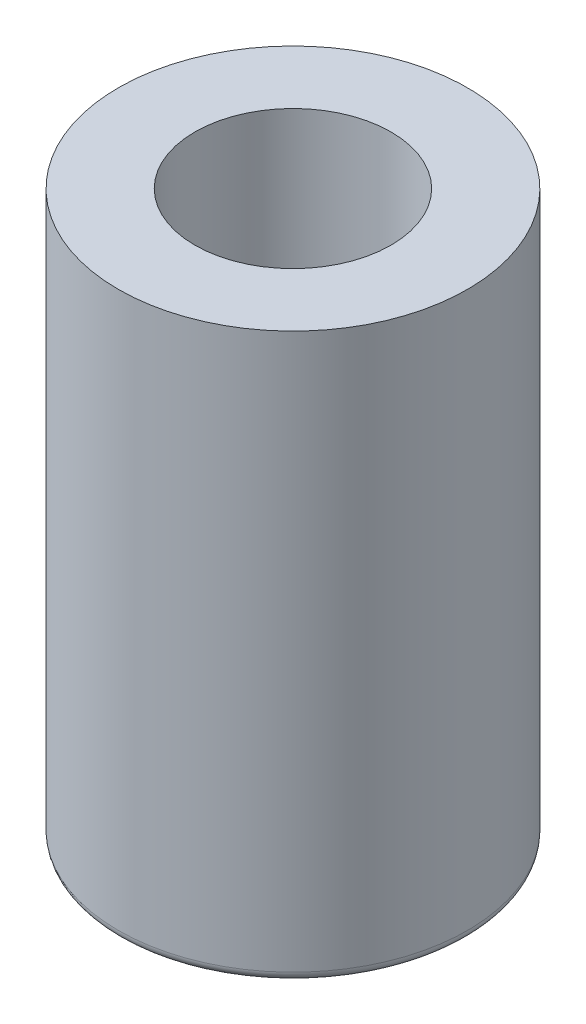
from build123d import *

# Parameters (mm, degrees)
ESQUISSE1_R   = 44.5
BRUT_DEPTH    = 144
ESQUISSE2_R   = 25
AL_SAGE_DEPTH = 158.151201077
ARRONDI_R     = 2.5


with BuildPart() as part:
    # Esquisse1 → Brut (new body)
    with BuildSketch(Plane(origin=(0, 0, 0), x_dir=(1, 0, 0), z_dir=(0, 1, 0))):
        with Locations(Location((0, 0, 0), (0, 0, 270))):
            Circle(ESQUISSE1_R)
    extrude(amount=BRUT_DEPTH)

    # Esquisse2 → Al_sage (cut, through all)
    with BuildSketch(Plane(origin=(0, 144, 0), x_dir=(1, 0, 0), z_dir=(0, 1, 0))):
        with Locations(Location((0, 0, 0), (0, 0, 270))):
            Circle(ESQUISSE2_R)
    extrude(amount=-AL_SAGE_DEPTH, mode=Mode.SUBTRACT)

    # Arrondi
    arrondi_edges = [part.edges().sort_by_distance(p)[0] for p in [
        (0, 0, -44.5),
    ]]
    fillet(arrondi_edges, radius=ARRONDI_R)


solid = part.part
